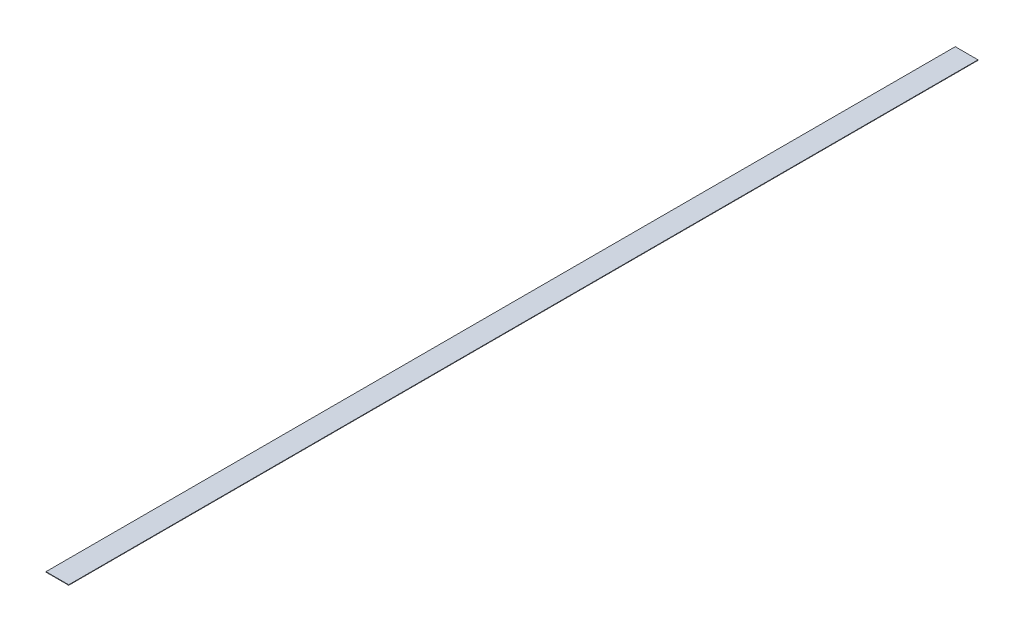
ISO-10303-21;
HEADER;
FILE_DESCRIPTION(('STEP AP214'),'2;1');
FILE_NAME('part.step','',(''),(''),'','','');
FILE_SCHEMA(('AUTOMOTIVE_DESIGN { 1 0 10303 214 1 1 1 1 }'));
ENDSEC;
DATA;
#1=APPLICATION_CONTEXT('core data for automotive mechanical design processes');
#2=APPLICATION_PROTOCOL_DEFINITION('international standard','automotive_design',2000,#1);
#3=PRODUCT_CONTEXT('',#1,'mechanical');
#4=PRODUCT('Part','Part','',(#3));
#5=PRODUCT_RELATED_PRODUCT_CATEGORY('part','',(#4));
#6=PRODUCT_DEFINITION_FORMATION('','',#4);
#7=PRODUCT_DEFINITION_CONTEXT('part definition',#1,'design');
#8=PRODUCT_DEFINITION('design','',#6,#7);
#9=PRODUCT_DEFINITION_SHAPE('','',#8);
#10=(LENGTH_UNIT() NAMED_UNIT(*) SI_UNIT(.MILLI.,.METRE.));
#11=(NAMED_UNIT(*) PLANE_ANGLE_UNIT() SI_UNIT($,.RADIAN.));
#12=(NAMED_UNIT(*) SI_UNIT($,.STERADIAN.) SOLID_ANGLE_UNIT());
#13=UNCERTAINTY_MEASURE_WITH_UNIT(LENGTH_MEASURE(1.E-05),#10,'distance_accuracy_value','');
#14=(GEOMETRIC_REPRESENTATION_CONTEXT(3) GLOBAL_UNCERTAINTY_ASSIGNED_CONTEXT((#13)) GLOBAL_UNIT_ASSIGNED_CONTEXT((#10,
#11,#12)) REPRESENTATION_CONTEXT('',''));
#15=CARTESIAN_POINT('',(0.,0.,0.));
#16=DIRECTION('',(0.,0.,1.));
#17=DIRECTION('',(1.,0.,0.));
#18=AXIS2_PLACEMENT_3D('',#15,#16,#17);
#19=CARTESIAN_POINT('',(-76.2000000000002,3.175,-3048.));
#20=DIRECTION('',(1.,0.,0.));
#21=DIRECTION('',(0.,0.,-1.));
#22=AXIS2_PLACEMENT_3D('',#19,#20,#21);
#23=PLANE('',#22);
#24=DIRECTION('',(0.,0.,1.));
#25=VECTOR('',#24,1.);
#26=CARTESIAN_POINT('',(-76.2000000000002,0.,-3048.));
#27=LINE('',#26,#25);
#28=CARTESIAN_POINT('',(-76.2000000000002,0.,-3048.));
#29=VERTEX_POINT('',#28);
#30=CARTESIAN_POINT('',(-76.1999999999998,0.,3048.));
#31=VERTEX_POINT('',#30);
#32=EDGE_CURVE('E96',#29,#31,#27,.T.);
#33=ORIENTED_EDGE('',*,*,#32,.T.);
#34=DIRECTION('',(0.,-1.,0.));
#35=VECTOR('',#34,1.);
#36=CARTESIAN_POINT('',(-76.1999999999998,3.175,3048.));
#37=LINE('',#36,#35);
#38=CARTESIAN_POINT('',(-76.1999999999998,3.175,3048.));
#39=VERTEX_POINT('',#38);
#40=EDGE_CURVE('E11',#39,#31,#37,.T.);
#41=ORIENTED_EDGE('',*,*,#40,.F.);
#42=DIRECTION('',(0.,0.,1.));
#43=VECTOR('',#42,1.);
#44=CARTESIAN_POINT('',(-76.2000000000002,3.175,-3048.));
#45=LINE('',#44,#43);
#46=CARTESIAN_POINT('',(-76.2000000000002,3.175,-3048.));
#47=VERTEX_POINT('',#46);
#48=EDGE_CURVE('E84',#47,#39,#45,.T.);
#49=ORIENTED_EDGE('',*,*,#48,.F.);
#50=DIRECTION('',(0.,-1.,0.));
#51=VECTOR('',#50,1.);
#52=CARTESIAN_POINT('',(-76.2000000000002,3.175,-3048.));
#53=LINE('',#52,#51);
#54=EDGE_CURVE('E92',#47,#29,#53,.T.);
#55=ORIENTED_EDGE('',*,*,#54,.T.);
#56=EDGE_LOOP('',(#33,#41,#49,#55));
#57=FACE_BOUND('',#56,.T.);
#58=ADVANCED_FACE('F33',(#57),#23,.F.);
#59=CARTESIAN_POINT('',(-76.1999999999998,3.175,3048.));
#60=DIRECTION('',(0.,0.,-1.));
#61=DIRECTION('',(-1.,0.,0.));
#62=AXIS2_PLACEMENT_3D('',#59,#60,#61);
#63=PLANE('',#62);
#64=DIRECTION('',(1.,0.,0.));
#65=VECTOR('',#64,1.);
#66=CARTESIAN_POINT('',(-76.1999999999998,0.,3048.));
#67=LINE('',#66,#65);
#68=CARTESIAN_POINT('',(76.1999999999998,0.,3048.));
#69=VERTEX_POINT('',#68);
#70=EDGE_CURVE('E88',#31,#69,#67,.T.);
#71=ORIENTED_EDGE('',*,*,#70,.T.);
#72=DIRECTION('',(0.,-1.,0.));
#73=VECTOR('',#72,1.);
#74=CARTESIAN_POINT('',(76.1999999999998,3.175,3048.));
#75=LINE('',#74,#73);
#76=CARTESIAN_POINT('',(76.1999999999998,3.175,3048.));
#77=VERTEX_POINT('',#76);
#78=EDGE_CURVE('E41',#77,#69,#75,.T.);
#79=ORIENTED_EDGE('',*,*,#78,.F.);
#80=DIRECTION('',(1.,0.,0.));
#81=VECTOR('',#80,1.);
#82=CARTESIAN_POINT('',(-76.1999999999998,3.175,3048.));
#83=LINE('',#82,#81);
#84=EDGE_CURVE('E79',#39,#77,#83,.T.);
#85=ORIENTED_EDGE('',*,*,#84,.F.);
#86=ORIENTED_EDGE('',*,*,#40,.T.);
#87=EDGE_LOOP('',(#71,#79,#85,#86));
#88=FACE_BOUND('',#87,.T.);
#89=ADVANCED_FACE('F87',(#88),#63,.F.);
#90=CARTESIAN_POINT('',(76.1999999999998,3.175,-3048.));
#91=DIRECTION('',(-1.,0.,0.));
#92=DIRECTION('',(0.,0.,1.));
#93=AXIS2_PLACEMENT_3D('',#90,#91,#92);
#94=PLANE('',#93);
#95=DIRECTION('',(0.,0.,-1.));
#96=VECTOR('',#95,1.);
#97=CARTESIAN_POINT('',(76.1999999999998,0.,-3048.));
#98=LINE('',#97,#96);
#99=CARTESIAN_POINT('',(76.1999999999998,0.,-3048.));
#100=VERTEX_POINT('',#99);
#101=EDGE_CURVE('E66',#69,#100,#98,.T.);
#102=ORIENTED_EDGE('',*,*,#101,.T.);
#103=DIRECTION('',(0.,-1.,0.));
#104=VECTOR('',#103,1.);
#105=CARTESIAN_POINT('',(76.1999999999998,3.175,-3048.));
#106=LINE('',#105,#104);
#107=CARTESIAN_POINT('',(76.1999999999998,3.175,-3048.));
#108=VERTEX_POINT('',#107);
#109=EDGE_CURVE('E89',#108,#100,#106,.T.);
#110=ORIENTED_EDGE('',*,*,#109,.F.);
#111=DIRECTION('',(0.,0.,-1.));
#112=VECTOR('',#111,1.);
#113=CARTESIAN_POINT('',(76.1999999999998,3.175,-3048.));
#114=LINE('',#113,#112);
#115=EDGE_CURVE('E82',#77,#108,#114,.T.);
#116=ORIENTED_EDGE('',*,*,#115,.F.);
#117=ORIENTED_EDGE('',*,*,#78,.T.);
#118=EDGE_LOOP('',(#102,#110,#116,#117));
#119=FACE_BOUND('',#118,.T.);
#120=ADVANCED_FACE('F90',(#119),#94,.F.);
#121=CARTESIAN_POINT('',(-76.2000000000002,3.175,-3048.));
#122=DIRECTION('',(0.,0.,1.));
#123=DIRECTION('',(1.,0.,0.));
#124=AXIS2_PLACEMENT_3D('',#121,#122,#123);
#125=PLANE('',#124);
#126=DIRECTION('',(-1.,0.,0.));
#127=VECTOR('',#126,1.);
#128=CARTESIAN_POINT('',(-76.2000000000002,0.,-3048.));
#129=LINE('',#128,#127);
#130=EDGE_CURVE('E72',#100,#29,#129,.T.);
#131=ORIENTED_EDGE('',*,*,#130,.T.);
#132=ORIENTED_EDGE('',*,*,#54,.F.);
#133=DIRECTION('',(-1.,0.,0.));
#134=VECTOR('',#133,1.);
#135=CARTESIAN_POINT('',(-76.2000000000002,3.175,-3048.));
#136=LINE('',#135,#134);
#137=EDGE_CURVE('E49',#108,#47,#136,.T.);
#138=ORIENTED_EDGE('',*,*,#137,.F.);
#139=ORIENTED_EDGE('',*,*,#109,.T.);
#140=EDGE_LOOP('',(#131,#132,#138,#139));
#141=FACE_BOUND('',#140,.T.);
#142=ADVANCED_FACE('F103',(#141),#125,.F.);
#143=CARTESIAN_POINT('',(0.,3.175,0.));
#144=DIRECTION('',(0.,1.,0.));
#145=DIRECTION('',(0.,0.,1.));
#146=AXIS2_PLACEMENT_3D('',#143,#144,#145);
#147=PLANE('',#146);
#148=ORIENTED_EDGE('',*,*,#48,.T.);
#149=ORIENTED_EDGE('',*,*,#84,.T.);
#150=ORIENTED_EDGE('',*,*,#115,.T.);
#151=ORIENTED_EDGE('',*,*,#137,.T.);
#152=EDGE_LOOP('',(#148,#149,#150,#151));
#153=FACE_BOUND('',#152,.T.);
#154=ADVANCED_FACE('F80',(#153),#147,.T.);
#155=CARTESIAN_POINT('',(0.,0.,0.));
#156=DIRECTION('',(0.,1.,0.));
#157=DIRECTION('',(0.,0.,1.));
#158=AXIS2_PLACEMENT_3D('',#155,#156,#157);
#159=PLANE('',#158);
#160=ORIENTED_EDGE('',*,*,#32,.F.);
#161=ORIENTED_EDGE('',*,*,#130,.F.);
#162=ORIENTED_EDGE('',*,*,#101,.F.);
#163=ORIENTED_EDGE('',*,*,#70,.F.);
#164=EDGE_LOOP('',(#160,#161,#162,#163));
#165=FACE_BOUND('',#164,.T.);
#166=ADVANCED_FACE('F106',(#165),#159,.F.);
#167=CLOSED_SHELL('',(#58,#89,#120,#142,#154,#166));
#168=MANIFOLD_SOLID_BREP('B2',#167);
#169=ADVANCED_BREP_SHAPE_REPRESENTATION('',(#18,#168),#14);
#170=SHAPE_DEFINITION_REPRESENTATION(#9,#169);
ENDSEC;
END-ISO-10303-21;
